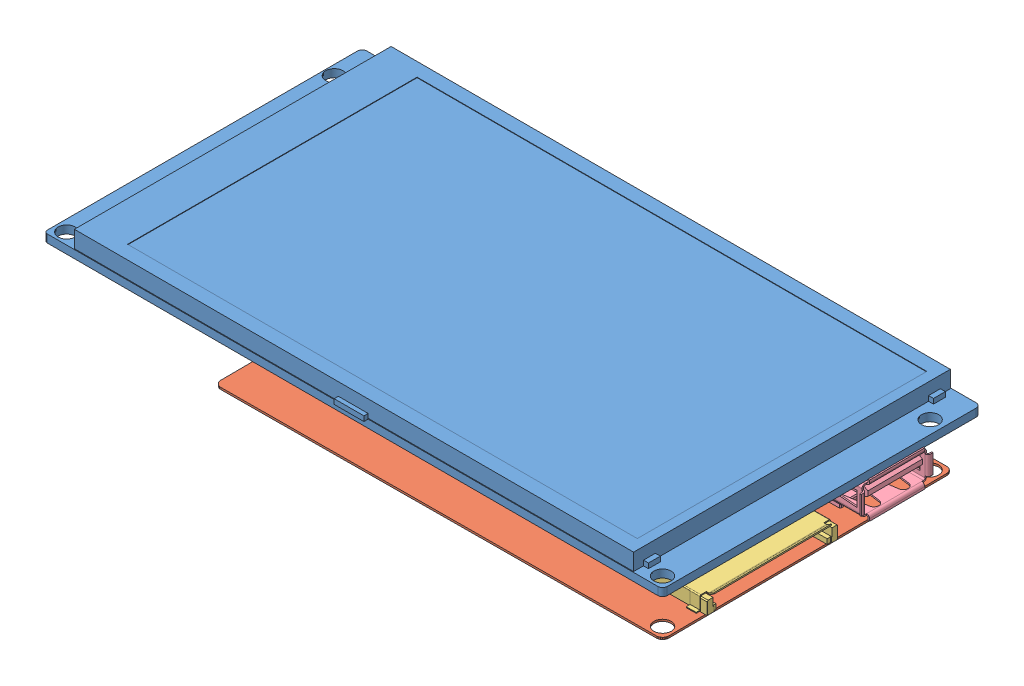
SolidWorks assembly 装配体18.sldasm, configuration 默认 (file format 9000). Lengths in mm.
Overall size (126.02 13.25 66).
11 component instances, 6 part files, 3 mates.
Components (placement in the parent):
- TFT4.6-1: TFT4.6.SLDPRT [默认] at (-13.327 3.8097 125) size (125 5 66)
- Screen207V1-1: Screen207V1.SLDASM [默认] at (48.8338 -3.3903 98.1373) x (-0.999982 0 0.005983) z (0 1 0) size (91.01 59.02 8.79)
  - Board_1-1: Board_1.sldprt [默认] at (0 0 -0.3912) size (90.02 59.02 0.39)
  - U13-1: U13.sldasm [默认] at origin size (26.36 28.03 4.15)
    - sd_big_1-1: sd_big_1.sldprt [默认] at (-0.3817 37.0464 0) x (0 -1 0) z (-1 0 0) size (28.03 4.15 26.36)
  - U_DISK-1: U_DISK.sldasm [默认] at (0 0 -0.07) size (15.16 17.26 8.79)
    - USBA_1-1: USBA_1.sldprt [默认] at (-1.0035 12.3441 4.2) x (0 -1 0) z (-1 0 0) size (17.26 8.79 15.16)
  - U3-1: U3.sldasm [默认] at origin size (14 14 1.55)
    - 487667936-1: 487667936.sldasm [默认] at (45.941 29.6954 0.05) size (14 14 1.55)
      - Extruded_1-1: Extruded_1.sldprt [默认] at origin size (14 14 1.55)
  - 插座-1: 插座.SLDPRT [默认] at (20.898 11.6917 0) x (1 0.000194 0) z (0.000194 -1 0) size (30 7.2 35.5)
Mates (geometry in assembly coordinates):
- 重合1: coincident: plane of TFT4.6-1 through (-13.327 3.8097 125) normal (0 -1 0); plane of Screen207V1-1/插座-1 through (65.089 3.8097 90.9482) normal (0 1 0)
- 同心4: concentric: cylinder of TFT4.6-1 through (46.5476 5.4097 100.451) axis (0 -1 0) radius 1.75; cylinder of Screen207V1-1/Board_1-1 through (46.5476 -3.7815 100.451) axis (0 -1 0) radius 1.75
- 同心5: concentric aligned: cylinder of TFT4.6-1 through (46.873 5.4097 154.85) axis (0 -1 0) radius 1.75; cylinder of Screen207V1-1/Board_1-1 through (46.873 -3.7815 154.85) axis (0 -1 0) radius 1.75
